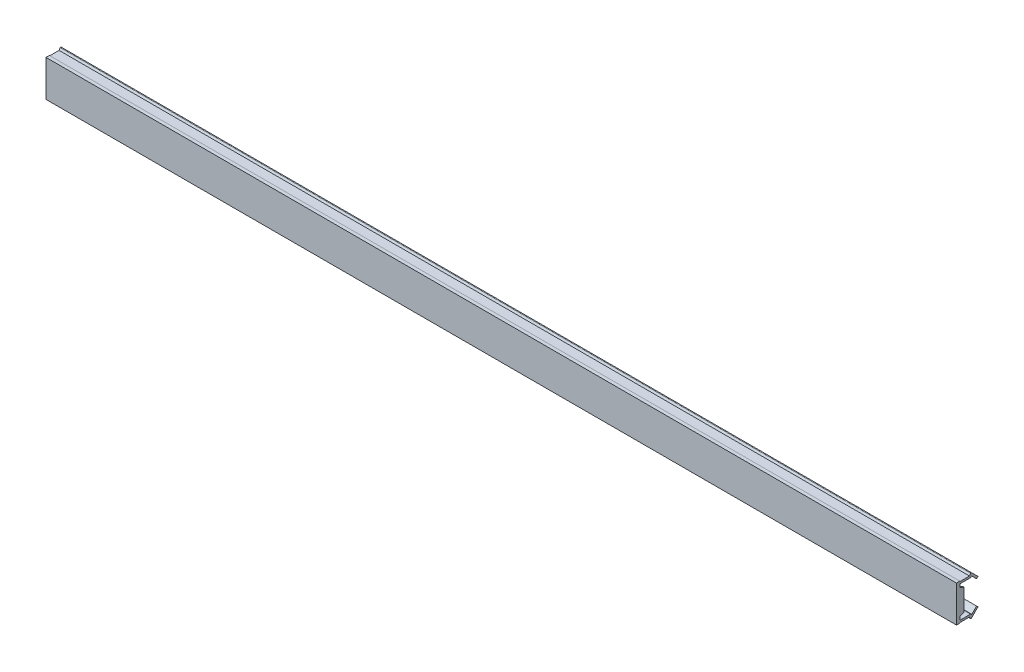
ISO-10303-21;
HEADER;
FILE_DESCRIPTION(('STEP AP214'),'2;1');
FILE_NAME('part.step','',(''),(''),'','','');
FILE_SCHEMA(('AUTOMOTIVE_DESIGN { 1 0 10303 214 1 1 1 1 }'));
ENDSEC;
DATA;
#1=APPLICATION_CONTEXT('core data for automotive mechanical design processes');
#2=APPLICATION_PROTOCOL_DEFINITION('international standard','automotive_design',2000,#1);
#3=PRODUCT_CONTEXT('',#1,'mechanical');
#4=PRODUCT('Part','Part','',(#3));
#5=PRODUCT_RELATED_PRODUCT_CATEGORY('part','',(#4));
#6=PRODUCT_DEFINITION_FORMATION('','',#4);
#7=PRODUCT_DEFINITION_CONTEXT('part definition',#1,'design');
#8=PRODUCT_DEFINITION('design','',#6,#7);
#9=PRODUCT_DEFINITION_SHAPE('','',#8);
#10=(LENGTH_UNIT() NAMED_UNIT(*) SI_UNIT(.MILLI.,.METRE.));
#11=(NAMED_UNIT(*) PLANE_ANGLE_UNIT() SI_UNIT($,.RADIAN.));
#12=(NAMED_UNIT(*) SI_UNIT($,.STERADIAN.) SOLID_ANGLE_UNIT());
#13=UNCERTAINTY_MEASURE_WITH_UNIT(LENGTH_MEASURE(1.E-05),#10,'distance_accuracy_value','');
#14=(GEOMETRIC_REPRESENTATION_CONTEXT(3) GLOBAL_UNCERTAINTY_ASSIGNED_CONTEXT((#13)) GLOBAL_UNIT_ASSIGNED_CONTEXT((#10,
#11,#12)) REPRESENTATION_CONTEXT('',''));
#15=CARTESIAN_POINT('',(0.,0.,0.));
#16=DIRECTION('',(0.,0.,1.));
#17=DIRECTION('',(1.,0.,0.));
#18=AXIS2_PLACEMENT_3D('',#15,#16,#17);
#19=CARTESIAN_POINT('',(0.,2.590763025,-1.1705));
#20=DIRECTION('',(0.,0.939692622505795,-0.342020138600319));
#21=DIRECTION('',(0.,0.342020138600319,0.939692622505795));
#22=AXIS2_PLACEMENT_3D('',#19,#20,#21);
#23=PLANE('',#22);
#24=DIRECTION('',(0.,-0.342020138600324,-0.939692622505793));
#25=VECTOR('',#24,1.);
#26=CARTESIAN_POINT('',(199.75,2.74381250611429,-0.75));
#27=LINE('',#26,#25);
#28=CARTESIAN_POINT('',(199.75,2.74381250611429,-0.749999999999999));
#29=VERTEX_POINT('',#28);
#30=CARTESIAN_POINT('',(199.75,2.43152605,-1.608));
#31=VERTEX_POINT('',#30);
#32=EDGE_CURVE('E409',#29,#31,#27,.T.);
#33=ORIENTED_EDGE('',*,*,#32,.F.);
#34=DIRECTION('',(1.,0.,0.));
#35=VECTOR('',#34,1.);
#36=CARTESIAN_POINT('',(100.25,2.74381250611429,-0.75));
#37=LINE('',#36,#35);
#38=CARTESIAN_POINT('',(0.75,2.74381250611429,-0.749999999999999));
#39=VERTEX_POINT('',#38);
#40=EDGE_CURVE('E326',#29,#39,#37,.F.);
#41=ORIENTED_EDGE('',*,*,#40,.T.);
#42=DIRECTION('',(0.,0.342020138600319,0.939692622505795));
#43=VECTOR('',#42,1.);
#44=CARTESIAN_POINT('',(0.75,2.590763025,-1.1705));
#45=LINE('',#44,#43);
#46=CARTESIAN_POINT('',(0.75,2.43152605,-1.608));
#47=VERTEX_POINT('',#46);
#48=EDGE_CURVE('E321',#39,#47,#45,.F.);
#49=ORIENTED_EDGE('',*,*,#48,.T.);
#50=DIRECTION('',(1.,0.,0.));
#51=VECTOR('',#50,1.);
#52=CARTESIAN_POINT('',(0.,2.43152605,-1.608));
#53=LINE('',#52,#51);
#54=CARTESIAN_POINT('',(0.,2.43152605,-1.608));
#55=VERTEX_POINT('',#54);
#56=EDGE_CURVE('E319',#47,#55,#53,.F.);
#57=ORIENTED_EDGE('',*,*,#56,.T.);
#58=DIRECTION('',(0.,0.342020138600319,0.939692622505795));
#59=VECTOR('',#58,1.);
#60=CARTESIAN_POINT('',(0.,2.590763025,-1.1705));
#61=LINE('',#60,#59);
#62=CARTESIAN_POINT('',(0.,2.75,-0.733));
#63=VERTEX_POINT('',#62);
#64=EDGE_CURVE('E317',#55,#63,#61,.T.);
#65=ORIENTED_EDGE('',*,*,#64,.T.);
#66=DIRECTION('',(-1.,0.,0.));
#67=VECTOR('',#66,1.);
#68=CARTESIAN_POINT('',(0.,2.75,-0.733));
#69=LINE('',#68,#67);
#70=CARTESIAN_POINT('',(200.,2.75,-0.733));
#71=VERTEX_POINT('',#70);
#72=EDGE_CURVE('E397',#71,#63,#69,.T.);
#73=ORIENTED_EDGE('',*,*,#72,.F.);
#74=DIRECTION('',(0.,0.342020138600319,0.939692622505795));
#75=VECTOR('',#74,1.);
#76=CARTESIAN_POINT('',(200.,2.590763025,-1.1705));
#77=LINE('',#76,#75);
#78=CARTESIAN_POINT('',(200.,2.43152605,-1.608));
#79=VERTEX_POINT('',#78);
#80=EDGE_CURVE('E314',#71,#79,#77,.F.);
#81=ORIENTED_EDGE('',*,*,#80,.T.);
#82=DIRECTION('',(1.,0.,0.));
#83=VECTOR('',#82,1.);
#84=CARTESIAN_POINT('',(0.,2.43152605,-1.608));
#85=LINE('',#84,#83);
#86=EDGE_CURVE('E232',#79,#31,#85,.F.);
#87=ORIENTED_EDGE('',*,*,#86,.T.);
#88=EDGE_LOOP('',(#33,#41,#49,#57,#65,#73,#81,#87));
#89=FACE_BOUND('',#88,.T.);
#90=ADVANCED_FACE('F15',(#89),#23,.T.);
#91=CARTESIAN_POINT('',(0.,3.5366617,-3.30191277));
#92=DIRECTION('',(1.,0.,0.));
#93=DIRECTION('',(0.,0.,-1.));
#94=AXIS2_PLACEMENT_3D('',#91,#92,#93);
#95=CYLINDRICAL_SURFACE('',#94,0.122000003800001);
#96=DIRECTION('',(1.,0.,0.));
#97=VECTOR('',#96,1.);
#98=CARTESIAN_POINT('',(0.,3.59766169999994,-3.19625766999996));
#99=LINE('',#98,#97);
#100=CARTESIAN_POINT('',(0.,3.5976616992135,-3.19625766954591));
#101=VERTEX_POINT('',#100);
#102=CARTESIAN_POINT('',(200.,3.5976616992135,-3.19625766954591));
#103=VERTEX_POINT('',#102);
#104=EDGE_CURVE('E229',#101,#103,#99,.T.);
#105=ORIENTED_EDGE('',*,*,#104,.F.);
#106=CARTESIAN_POINT('',(0.,3.5366617,-3.30191277));
#107=DIRECTION('',(1.,0.,0.));
#108=DIRECTION('',(0.,0.,-1.));
#109=AXIS2_PLACEMENT_3D('',#106,#107,#108);
#110=CIRCLE('',#109,0.122000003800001);
#111=CARTESIAN_POINT('',(0.,3.62292873,-3.3881798));
#112=VERTEX_POINT('',#111);
#113=EDGE_CURVE('E18',#112,#101,#110,.T.);
#114=ORIENTED_EDGE('',*,*,#113,.F.);
#115=DIRECTION('',(1.,0.,0.));
#116=VECTOR('',#115,1.);
#117=CARTESIAN_POINT('',(0.,3.62292873,-3.3881798));
#118=LINE('',#117,#116);
#119=CARTESIAN_POINT('',(200.,3.62292873,-3.3881798));
#120=VERTEX_POINT('',#119);
#121=EDGE_CURVE('E226',#120,#112,#118,.F.);
#122=ORIENTED_EDGE('',*,*,#121,.F.);
#123=CARTESIAN_POINT('',(200.,3.5366617,-3.30191277));
#124=DIRECTION('',(1.,0.,0.));
#125=DIRECTION('',(0.,0.,-1.));
#126=AXIS2_PLACEMENT_3D('',#123,#124,#125);
#127=CIRCLE('',#126,0.122000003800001);
#128=EDGE_CURVE('E231',#103,#120,#127,.F.);
#129=ORIENTED_EDGE('',*,*,#128,.F.);
#130=EDGE_LOOP('',(#105,#114,#122,#129));
#131=FACE_BOUND('',#130,.T.);
#132=ADVANCED_FACE('F223',(#131),#95,.F.);
#133=CARTESIAN_POINT('',(0.,3.105375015,-3.905733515));
#134=DIRECTION('',(0.,-0.707106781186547,0.707106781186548));
#135=DIRECTION('',(0.,-0.707106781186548,-0.707106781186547));
#136=AXIS2_PLACEMENT_3D('',#133,#134,#135);
#137=PLANE('',#136);
#138=DIRECTION('',(0.,-0.707106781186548,-0.707106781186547));
#139=VECTOR('',#138,1.);
#140=CARTESIAN_POINT('',(0.,3.105375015,-3.905733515));
#141=LINE('',#140,#139);
#142=CARTESIAN_POINT('',(0.,2.5878213,-4.42328723));
#143=VERTEX_POINT('',#142);
#144=EDGE_CURVE('E234',#112,#143,#141,.T.);
#145=ORIENTED_EDGE('',*,*,#144,.T.);
#146=DIRECTION('',(1.,0.,0.));
#147=VECTOR('',#146,1.);
#148=CARTESIAN_POINT('',(0.,2.5878213,-4.42328723));
#149=LINE('',#148,#147);
#150=CARTESIAN_POINT('',(200.,2.5878213,-4.42328723));
#151=VERTEX_POINT('',#150);
#152=EDGE_CURVE('E282',#151,#143,#149,.F.);
#153=ORIENTED_EDGE('',*,*,#152,.F.);
#154=DIRECTION('',(0.,-0.707106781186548,-0.707106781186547));
#155=VECTOR('',#154,1.);
#156=CARTESIAN_POINT('',(200.,3.105375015,-3.905733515));
#157=LINE('',#156,#155);
#158=EDGE_CURVE('E245',#151,#120,#157,.F.);
#159=ORIENTED_EDGE('',*,*,#158,.T.);
#160=ORIENTED_EDGE('',*,*,#121,.T.);
#161=EDGE_LOOP('',(#145,#153,#159,#160));
#162=FACE_BOUND('',#161,.T.);
#163=ADVANCED_FACE('F244',(#162),#137,.T.);
#164=CARTESIAN_POINT('',(0.,-3.105374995,-3.905733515));
#165=DIRECTION('',(0.,0.707106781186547,0.707106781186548));
#166=DIRECTION('',(0.,-0.707106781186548,0.707106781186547));
#167=AXIS2_PLACEMENT_3D('',#164,#165,#166);
#168=PLANE('',#167);
#169=DIRECTION('',(0.,-0.707106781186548,0.707106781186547));
#170=VECTOR('',#169,1.);
#171=CARTESIAN_POINT('',(0.,-3.105374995,-3.905733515));
#172=LINE('',#171,#170);
#173=CARTESIAN_POINT('',(0.,-2.58782128,-4.42328723));
#174=VERTEX_POINT('',#173);
#175=CARTESIAN_POINT('',(0.,-3.62292870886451,-3.38817979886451));
#176=VERTEX_POINT('',#175);
#177=EDGE_CURVE('E269',#174,#176,#172,.T.);
#178=ORIENTED_EDGE('',*,*,#177,.T.);
#179=DIRECTION('',(1.,0.,0.));
#180=VECTOR('',#179,1.);
#181=CARTESIAN_POINT('',(0.,-3.62292870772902,-3.38817979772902));
#182=LINE('',#181,#180);
#183=CARTESIAN_POINT('',(200.,-3.62292870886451,-3.38817979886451));
#184=VERTEX_POINT('',#183);
#185=EDGE_CURVE('E250',#176,#184,#182,.T.);
#186=ORIENTED_EDGE('',*,*,#185,.T.);
#187=DIRECTION('',(0.,-0.707106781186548,0.707106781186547));
#188=VECTOR('',#187,1.);
#189=CARTESIAN_POINT('',(200.,-3.105374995,-3.905733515));
#190=LINE('',#189,#188);
#191=CARTESIAN_POINT('',(200.,-2.58782128,-4.42328723));
#192=VERTEX_POINT('',#191);
#193=EDGE_CURVE('E242',#184,#192,#190,.F.);
#194=ORIENTED_EDGE('',*,*,#193,.T.);
#195=DIRECTION('',(1.,0.,0.));
#196=VECTOR('',#195,1.);
#197=CARTESIAN_POINT('',(0.,-2.58782128,-4.42328723));
#198=LINE('',#197,#196);
#199=EDGE_CURVE('E385',#174,#192,#198,.T.);
#200=ORIENTED_EDGE('',*,*,#199,.F.);
#201=EDGE_LOOP('',(#178,#186,#194,#200));
#202=FACE_BOUND('',#201,.T.);
#203=ADVANCED_FACE('F672',(#202),#168,.T.);
#204=CARTESIAN_POINT('',(0.,-3.53666168,-3.30191277));
#205=DIRECTION('',(1.,0.,0.));
#206=DIRECTION('',(0.,0.,-1.));
#207=AXIS2_PLACEMENT_3D('',#204,#205,#206);
#208=CYLINDRICAL_SURFACE('',#207,0.122000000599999);
#209=ORIENTED_EDGE('',*,*,#185,.F.);
#210=CARTESIAN_POINT('',(0.,-3.53666168,-3.30191277));
#211=DIRECTION('',(1.,0.,0.));
#212=DIRECTION('',(0.,0.,-1.));
#213=AXIS2_PLACEMENT_3D('',#210,#211,#212);
#214=CIRCLE('',#213,0.122000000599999);
#215=CARTESIAN_POINT('',(0.,-3.59766167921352,-3.19625766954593));
#216=VERTEX_POINT('',#215);
#217=EDGE_CURVE('E268',#216,#176,#214,.T.);
#218=ORIENTED_EDGE('',*,*,#217,.F.);
#219=DIRECTION('',(1.,0.,0.));
#220=VECTOR('',#219,1.);
#221=CARTESIAN_POINT('',(0.,-3.59766168,-3.19625767));
#222=LINE('',#221,#220);
#223=CARTESIAN_POINT('',(200.,-3.59766167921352,-3.19625766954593));
#224=VERTEX_POINT('',#223);
#225=EDGE_CURVE('E427',#224,#216,#222,.F.);
#226=ORIENTED_EDGE('',*,*,#225,.F.);
#227=CARTESIAN_POINT('',(200.,-3.53666168,-3.30191277));
#228=DIRECTION('',(1.,0.,0.));
#229=DIRECTION('',(0.,0.,-1.));
#230=AXIS2_PLACEMENT_3D('',#227,#228,#229);
#231=CIRCLE('',#230,0.122000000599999);
#232=EDGE_CURVE('E265',#184,#224,#231,.F.);
#233=ORIENTED_EDGE('',*,*,#232,.F.);
#234=EDGE_LOOP('',(#209,#218,#226,#233));
#235=FACE_BOUND('',#234,.T.);
#236=ADVANCED_FACE('F677',(#235),#208,.F.);
#237=CARTESIAN_POINT('',(0.,-2.590763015,-1.1705));
#238=DIRECTION('',(0.,-0.939692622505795,-0.342020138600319));
#239=DIRECTION('',(0.,0.342020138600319,-0.939692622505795));
#240=AXIS2_PLACEMENT_3D('',#237,#238,#239);
#241=PLANE('',#240);
#242=DIRECTION('',(0.,0.342020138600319,-0.939692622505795));
#243=VECTOR('',#242,1.);
#244=CARTESIAN_POINT('',(0.,-2.590763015,-1.1705));
#245=LINE('',#244,#243);
#246=CARTESIAN_POINT('',(0.,-2.74999999,-0.733));
#247=VERTEX_POINT('',#246);
#248=CARTESIAN_POINT('',(0.,-2.43152604,-1.608));
#249=VERTEX_POINT('',#248);
#250=EDGE_CURVE('E417',#247,#249,#245,.T.);
#251=ORIENTED_EDGE('',*,*,#250,.T.);
#252=DIRECTION('',(1.,0.,0.));
#253=VECTOR('',#252,1.);
#254=CARTESIAN_POINT('',(0.,-2.43152604,-1.608));
#255=LINE('',#254,#253);
#256=CARTESIAN_POINT('',(0.75,-2.43152604,-1.608));
#257=VERTEX_POINT('',#256);
#258=EDGE_CURVE('E415',#249,#257,#255,.T.);
#259=ORIENTED_EDGE('',*,*,#258,.T.);
#260=DIRECTION('',(0.,0.342020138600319,-0.939692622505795));
#261=VECTOR('',#260,1.);
#262=CARTESIAN_POINT('',(0.75,-2.590763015,-1.1705));
#263=LINE('',#262,#261);
#264=CARTESIAN_POINT('',(0.75,-2.74381249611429,-0.749999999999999));
#265=VERTEX_POINT('',#264);
#266=EDGE_CURVE('E267',#257,#265,#263,.F.);
#267=ORIENTED_EDGE('',*,*,#266,.T.);
#268=DIRECTION('',(1.,0.,0.));
#269=VECTOR('',#268,1.);
#270=CARTESIAN_POINT('',(100.25,-2.74381249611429,-0.75));
#271=LINE('',#270,#269);
#272=CARTESIAN_POINT('',(199.75,-2.74381249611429,-0.749999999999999));
#273=VERTEX_POINT('',#272);
#274=EDGE_CURVE('E413',#265,#273,#271,.T.);
#275=ORIENTED_EDGE('',*,*,#274,.T.);
#276=DIRECTION('',(0.,-0.342020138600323,0.939692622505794));
#277=VECTOR('',#276,1.);
#278=CARTESIAN_POINT('',(199.75,-2.43152604,-1.608));
#279=LINE('',#278,#277);
#280=CARTESIAN_POINT('',(199.75,-2.43152604,-1.608));
#281=VERTEX_POINT('',#280);
#282=EDGE_CURVE('E406',#281,#273,#279,.T.);
#283=ORIENTED_EDGE('',*,*,#282,.F.);
#284=DIRECTION('',(1.,0.,0.));
#285=VECTOR('',#284,1.);
#286=CARTESIAN_POINT('',(0.,-2.43152604,-1.608));
#287=LINE('',#286,#285);
#288=CARTESIAN_POINT('',(200.,-2.43152604,-1.608));
#289=VERTEX_POINT('',#288);
#290=EDGE_CURVE('E423',#281,#289,#287,.T.);
#291=ORIENTED_EDGE('',*,*,#290,.T.);
#292=DIRECTION('',(0.,0.342020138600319,-0.939692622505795));
#293=VECTOR('',#292,1.);
#294=CARTESIAN_POINT('',(200.,-2.590763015,-1.1705));
#295=LINE('',#294,#293);
#296=CARTESIAN_POINT('',(200.,-2.74999999,-0.733));
#297=VERTEX_POINT('',#296);
#298=EDGE_CURVE('E420',#289,#297,#295,.F.);
#299=ORIENTED_EDGE('',*,*,#298,.T.);
#300=DIRECTION('',(-1.,0.,0.));
#301=VECTOR('',#300,1.);
#302=CARTESIAN_POINT('',(0.,-2.74999999,-0.733));
#303=LINE('',#302,#301);
#304=EDGE_CURVE('E373',#247,#297,#303,.F.);
#305=ORIENTED_EDGE('',*,*,#304,.F.);
#306=EDGE_LOOP('',(#251,#259,#267,#275,#283,#291,#299,#305));
#307=FACE_BOUND('',#306,.T.);
#308=ADVANCED_FACE('F689',(#307),#241,.T.);
#309=CARTESIAN_POINT('',(100.25,0.,-0.75));
#310=DIRECTION('',(0.,0.,1.));
#311=DIRECTION('',(1.,0.,0.));
#312=AXIS2_PLACEMENT_3D('',#309,#310,#311);
#313=PLANE('',#312);
#314=DIRECTION('',(0.,1.,0.));
#315=VECTOR('',#314,1.);
#316=CARTESIAN_POINT('',(199.75,0.,-0.75));
#317=LINE('',#316,#315);
#318=EDGE_CURVE('E403',#273,#29,#317,.T.);
#319=ORIENTED_EDGE('',*,*,#318,.F.);
#320=ORIENTED_EDGE('',*,*,#274,.F.);
#321=DIRECTION('',(0.,1.,0.));
#322=VECTOR('',#321,1.);
#323=CARTESIAN_POINT('',(0.75,0.,-0.75));
#324=LINE('',#323,#322);
#325=EDGE_CURVE('E332',#39,#265,#324,.F.);
#326=ORIENTED_EDGE('',*,*,#325,.F.);
#327=ORIENTED_EDGE('',*,*,#40,.F.);
#328=EDGE_LOOP('',(#319,#320,#326,#327));
#329=FACE_BOUND('',#328,.T.);
#330=ADVANCED_FACE('F697',(#329),#313,.F.);
#331=CARTESIAN_POINT('',(199.75,0.,-1.25));
#332=DIRECTION('',(-1.,0.,0.));
#333=DIRECTION('',(0.,0.,1.));
#334=AXIS2_PLACEMENT_3D('',#331,#332,#333);
#335=PLANE('',#334);
#336=ORIENTED_EDGE('',*,*,#282,.T.);
#337=ORIENTED_EDGE('',*,*,#318,.T.);
#338=ORIENTED_EDGE('',*,*,#32,.T.);
#339=DIRECTION('',(0.,1.,0.));
#340=VECTOR('',#339,1.);
#341=CARTESIAN_POINT('',(199.75,4.99999996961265E-09,-1.608));
#342=LINE('',#341,#340);
#343=EDGE_CURVE('E369',#281,#31,#342,.T.);
#344=ORIENTED_EDGE('',*,*,#343,.F.);
#345=EDGE_LOOP('',(#336,#337,#338,#344));
#346=FACE_BOUND('',#345,.T.);
#347=ADVANCED_FACE('F694',(#346),#335,.T.);
#348=CARTESIAN_POINT('',(0.,3.106000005,-0.733));
#349=DIRECTION('',(0.,0.,-1.));
#350=DIRECTION('',(-1.,0.,0.));
#351=AXIS2_PLACEMENT_3D('',#348,#349,#350);
#352=PLANE('',#351);
#353=DIRECTION('',(0.,1.,0.));
#354=VECTOR('',#353,1.);
#355=CARTESIAN_POINT('',(0.,3.106000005,-0.733));
#356=LINE('',#355,#354);
#357=CARTESIAN_POINT('',(0.,3.46200001,-0.733));
#358=VERTEX_POINT('',#357);
#359=EDGE_CURVE('E304',#63,#358,#356,.T.);
#360=ORIENTED_EDGE('',*,*,#359,.T.);
#361=DIRECTION('',(1.,0.,0.));
#362=VECTOR('',#361,1.);
#363=CARTESIAN_POINT('',(0.,3.46200001,-0.733));
#364=LINE('',#363,#362);
#365=CARTESIAN_POINT('',(200.,3.46200001,-0.733));
#366=VERTEX_POINT('',#365);
#367=EDGE_CURVE('E293',#366,#358,#364,.F.);
#368=ORIENTED_EDGE('',*,*,#367,.F.);
#369=DIRECTION('',(0.,1.,0.));
#370=VECTOR('',#369,1.);
#371=CARTESIAN_POINT('',(200.,3.106000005,-0.733));
#372=LINE('',#371,#370);
#373=EDGE_CURVE('E400',#366,#71,#372,.F.);
#374=ORIENTED_EDGE('',*,*,#373,.T.);
#375=ORIENTED_EDGE('',*,*,#72,.T.);
#376=EDGE_LOOP('',(#360,#368,#374,#375));
#377=FACE_BOUND('',#376,.T.);
#378=ADVANCED_FACE('F543',(#377),#352,.T.);
#379=CARTESIAN_POINT('',(0.,3.52983085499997,-3.15709551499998));
#380=DIRECTION('',(0.,-0.499999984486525,-0.866025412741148));
#381=DIRECTION('',(0.,0.866025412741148,-0.499999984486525));
#382=AXIS2_PLACEMENT_3D('',#379,#380,#381);
#383=PLANE('',#382);
#384=DIRECTION('',(0.,0.866025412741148,-0.499999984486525));
#385=VECTOR('',#384,1.);
#386=CARTESIAN_POINT('',(0.,3.52983085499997,-3.15709551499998));
#387=LINE('',#386,#385);
#388=CARTESIAN_POINT('',(0.,3.46200001,-3.11793336));
#389=VERTEX_POINT('',#388);
#390=EDGE_CURVE('E278',#389,#101,#387,.T.);
#391=ORIENTED_EDGE('',*,*,#390,.T.);
#392=ORIENTED_EDGE('',*,*,#104,.T.);
#393=DIRECTION('',(0.,0.866025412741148,-0.499999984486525));
#394=VECTOR('',#393,1.);
#395=CARTESIAN_POINT('',(200.,3.52983085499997,-3.15709551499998));
#396=LINE('',#395,#394);
#397=CARTESIAN_POINT('',(200.,3.46200001,-3.11793336));
#398=VERTEX_POINT('',#397);
#399=EDGE_CURVE('E273',#103,#398,#396,.F.);
#400=ORIENTED_EDGE('',*,*,#399,.T.);
#401=DIRECTION('',(1.,0.,0.));
#402=VECTOR('',#401,1.);
#403=CARTESIAN_POINT('',(0.,3.46200001,-3.11793336));
#404=LINE('',#403,#402);
#405=EDGE_CURVE('E290',#389,#398,#404,.T.);
#406=ORIENTED_EDGE('',*,*,#405,.F.);
#407=EDGE_LOOP('',(#391,#392,#400,#406));
#408=FACE_BOUND('',#407,.T.);
#409=ADVANCED_FACE('F275',(#408),#383,.T.);
#410=CARTESIAN_POINT('',(0.,2.742677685,-4.578143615));
#411=DIRECTION('',(0.,-0.707106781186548,-0.707106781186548));
#412=DIRECTION('',(0.,0.707106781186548,-0.707106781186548));
#413=AXIS2_PLACEMENT_3D('',#410,#411,#412);
#414=PLANE('',#413);
#415=DIRECTION('',(0.,0.707106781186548,-0.707106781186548));
#416=VECTOR('',#415,1.);
#417=CARTESIAN_POINT('',(0.,2.742677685,-4.578143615));
#418=LINE('',#417,#416);
#419=CARTESIAN_POINT('',(0.,2.89753407,-4.733));
#420=VERTEX_POINT('',#419);
#421=EDGE_CURVE('E238',#143,#420,#418,.T.);
#422=ORIENTED_EDGE('',*,*,#421,.T.);
#423=DIRECTION('',(1.,0.,0.));
#424=VECTOR('',#423,1.);
#425=CARTESIAN_POINT('',(0.,2.89753407,-4.733));
#426=LINE('',#425,#424);
#427=CARTESIAN_POINT('',(200.,2.89753407,-4.733));
#428=VERTEX_POINT('',#427);
#429=EDGE_CURVE('E292',#428,#420,#426,.F.);
#430=ORIENTED_EDGE('',*,*,#429,.F.);
#431=DIRECTION('',(0.,0.707106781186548,-0.707106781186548));
#432=VECTOR('',#431,1.);
#433=CARTESIAN_POINT('',(200.,2.742677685,-4.578143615));
#434=LINE('',#433,#432);
#435=EDGE_CURVE('E279',#428,#151,#434,.F.);
#436=ORIENTED_EDGE('',*,*,#435,.T.);
#437=ORIENTED_EDGE('',*,*,#152,.T.);
#438=EDGE_LOOP('',(#422,#430,#436,#437));
#439=FACE_BOUND('',#438,.T.);
#440=ADVANCED_FACE('F525',(#439),#414,.T.);
#441=CARTESIAN_POINT('',(0.,4.25000001,-3.208));
#442=DIRECTION('',(1.,0.,0.));
#443=DIRECTION('',(0.,0.,-1.));
#444=AXIS2_PLACEMENT_3D('',#441,#442,#443);
#445=CYLINDRICAL_SURFACE('',#444,0.122000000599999);
#446=CARTESIAN_POINT('',(0.,4.25000001,-3.208));
#447=DIRECTION('',(1.,0.,0.));
#448=DIRECTION('',(0.,0.,-1.));
#449=AXIS2_PLACEMENT_3D('',#446,#447,#448);
#450=CIRCLE('',#449,0.122000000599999);
#451=CARTESIAN_POINT('',(0.,4.33626703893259,-3.29426702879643));
#452=VERTEX_POINT('',#451);
#453=CARTESIAN_POINT('',(0.,4.31100001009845,-3.10234490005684));
#454=VERTEX_POINT('',#453);
#455=EDGE_CURVE('E260',#452,#454,#450,.T.);
#456=ORIENTED_EDGE('',*,*,#455,.T.);
#457=DIRECTION('',(1.,0.,0.));
#458=VECTOR('',#457,1.);
#459=CARTESIAN_POINT('',(0.,4.31100001,-3.1023449));
#460=LINE('',#459,#458);
#461=CARTESIAN_POINT('',(200.,4.31100001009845,-3.10234490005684));
#462=VERTEX_POINT('',#461);
#463=EDGE_CURVE('E494',#462,#454,#460,.F.);
#464=ORIENTED_EDGE('',*,*,#463,.F.);
#465=CARTESIAN_POINT('',(200.,4.25000001,-3.208));
#466=DIRECTION('',(1.,0.,0.));
#467=DIRECTION('',(0.,0.,-1.));
#468=AXIS2_PLACEMENT_3D('',#465,#466,#467);
#469=CIRCLE('',#468,0.122000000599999);
#470=CARTESIAN_POINT('',(200.,4.33626703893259,-3.29426702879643));
#471=VERTEX_POINT('',#470);
#472=EDGE_CURVE('E263',#462,#471,#469,.F.);
#473=ORIENTED_EDGE('',*,*,#472,.T.);
#474=DIRECTION('',(1.,0.,0.));
#475=VECTOR('',#474,1.);
#476=CARTESIAN_POINT('',(0.,4.33626704,-3.29426703));
#477=LINE('',#476,#475);
#478=EDGE_CURVE('E358',#452,#471,#477,.T.);
#479=ORIENTED_EDGE('',*,*,#478,.F.);
#480=EDGE_LOOP('',(#456,#464,#473,#479));
#481=FACE_BOUND('',#480,.T.);
#482=ADVANCED_FACE('F611',(#481),#445,.T.);
#483=CARTESIAN_POINT('',(0.,4.10550001,-2.98369942));
#484=DIRECTION('',(0.,0.499999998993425,0.866025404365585));
#485=DIRECTION('',(0.,-0.866025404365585,0.499999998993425));
#486=AXIS2_PLACEMENT_3D('',#483,#484,#485);
#487=PLANE('',#486);
#488=DIRECTION('',(0.,-0.866025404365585,0.499999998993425));
#489=VECTOR('',#488,1.);
#490=CARTESIAN_POINT('',(0.,4.10550001,-2.98369942));
#491=LINE('',#490,#489);
#492=CARTESIAN_POINT('',(0.,3.90000001,-2.86505394));
#493=VERTEX_POINT('',#492);
#494=EDGE_CURVE('E475',#454,#493,#491,.T.);
#495=ORIENTED_EDGE('',*,*,#494,.T.);
#496=DIRECTION('',(1.,0.,0.));
#497=VECTOR('',#496,1.);
#498=CARTESIAN_POINT('',(0.,3.90000001,-2.86505394));
#499=LINE('',#498,#497);
#500=CARTESIAN_POINT('',(200.,3.90000001,-2.86505394));
#501=VERTEX_POINT('',#500);
#502=EDGE_CURVE('E357',#501,#493,#499,.F.);
#503=ORIENTED_EDGE('',*,*,#502,.F.);
#504=DIRECTION('',(0.,-0.866025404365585,0.499999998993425));
#505=VECTOR('',#504,1.);
#506=CARTESIAN_POINT('',(200.,4.10550001,-2.98369942));
#507=LINE('',#506,#505);
#508=EDGE_CURVE('E262',#501,#462,#507,.F.);
#509=ORIENTED_EDGE('',*,*,#508,.T.);
#510=ORIENTED_EDGE('',*,*,#463,.T.);
#511=EDGE_LOOP('',(#495,#503,#509,#510));
#512=FACE_BOUND('',#511,.T.);
#513=ADVANCED_FACE('F608',(#512),#487,.T.);
#514=CARTESIAN_POINT('',(0.,-4.10549998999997,-2.98369941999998));
#515=DIRECTION('',(0.,-0.499999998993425,0.866025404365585));
#516=DIRECTION('',(0.,-0.866025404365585,-0.499999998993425));
#517=AXIS2_PLACEMENT_3D('',#514,#515,#516);
#518=PLANE('',#517);
#519=DIRECTION('',(0.,-0.866025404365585,-0.499999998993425));
#520=VECTOR('',#519,1.);
#521=CARTESIAN_POINT('',(0.,-4.10549998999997,-2.98369941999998));
#522=LINE('',#521,#520);
#523=CARTESIAN_POINT('',(0.,-3.89999999,-2.86505394));
#524=VERTEX_POINT('',#523);
#525=CARTESIAN_POINT('',(0.,-4.31099999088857,-3.10234489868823));
#526=VERTEX_POINT('',#525);
#527=EDGE_CURVE('E259',#524,#526,#522,.T.);
#528=ORIENTED_EDGE('',*,*,#527,.T.);
#529=DIRECTION('',(1.,0.,0.));
#530=VECTOR('',#529,1.);
#531=CARTESIAN_POINT('',(0.,-4.31099999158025,-3.10234489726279));
#532=LINE('',#531,#530);
#533=CARTESIAN_POINT('',(200.,-4.31099999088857,-3.10234489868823));
#534=VERTEX_POINT('',#533);
#535=EDGE_CURVE('E255',#534,#526,#532,.F.);
#536=ORIENTED_EDGE('',*,*,#535,.F.);
#537=DIRECTION('',(0.,-0.866025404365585,-0.499999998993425));
#538=VECTOR('',#537,1.);
#539=CARTESIAN_POINT('',(200.,-4.10549998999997,-2.98369941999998));
#540=LINE('',#539,#538);
#541=CARTESIAN_POINT('',(200.,-3.89999999,-2.86505394));
#542=VERTEX_POINT('',#541);
#543=EDGE_CURVE('E471',#534,#542,#540,.F.);
#544=ORIENTED_EDGE('',*,*,#543,.T.);
#545=DIRECTION('',(1.,0.,0.));
#546=VECTOR('',#545,1.);
#547=CARTESIAN_POINT('',(0.,-3.89999999,-2.86505394));
#548=LINE('',#547,#546);
#549=EDGE_CURVE('E350',#524,#542,#548,.T.);
#550=ORIENTED_EDGE('',*,*,#549,.F.);
#551=EDGE_LOOP('',(#528,#536,#544,#550));
#552=FACE_BOUND('',#551,.T.);
#553=ADVANCED_FACE('F661',(#552),#518,.T.);
#554=CARTESIAN_POINT('',(0.,-4.24999999,-3.208));
#555=DIRECTION('',(1.,0.,0.));
#556=DIRECTION('',(0.,0.,-1.));
#557=AXIS2_PLACEMENT_3D('',#554,#555,#556);
#558=CYLINDRICAL_SURFACE('',#557,0.122000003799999);
#559=CARTESIAN_POINT('',(0.,-4.24999999,-3.208));
#560=DIRECTION('',(1.,0.,0.));
#561=DIRECTION('',(0.,0.,-1.));
#562=AXIS2_PLACEMENT_3D('',#559,#560,#561);
#563=CIRCLE('',#562,0.122000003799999);
#564=CARTESIAN_POINT('',(0.,-4.33626702,-3.29426703));
#565=VERTEX_POINT('',#564);
#566=EDGE_CURVE('E252',#526,#565,#563,.T.);
#567=ORIENTED_EDGE('',*,*,#566,.T.);
#568=DIRECTION('',(1.,0.,0.));
#569=VECTOR('',#568,1.);
#570=CARTESIAN_POINT('',(0.,-4.33626702,-3.29426703));
#571=LINE('',#570,#569);
#572=CARTESIAN_POINT('',(200.,-4.33626702,-3.29426703));
#573=VERTEX_POINT('',#572);
#574=EDGE_CURVE('E346',#573,#565,#571,.F.);
#575=ORIENTED_EDGE('',*,*,#574,.F.);
#576=CARTESIAN_POINT('',(200.,-4.24999999,-3.208));
#577=DIRECTION('',(1.,0.,0.));
#578=DIRECTION('',(0.,0.,-1.));
#579=AXIS2_PLACEMENT_3D('',#576,#577,#578);
#580=CIRCLE('',#579,0.122000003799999);
#581=EDGE_CURVE('E256',#573,#534,#580,.F.);
#582=ORIENTED_EDGE('',*,*,#581,.T.);
#583=ORIENTED_EDGE('',*,*,#535,.T.);
#584=EDGE_LOOP('',(#567,#575,#582,#583));
#585=FACE_BOUND('',#584,.T.);
#586=ADVANCED_FACE('F665',(#585),#558,.T.);
#587=CARTESIAN_POINT('',(0.,-2.742677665,-4.578143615));
#588=DIRECTION('',(0.,0.707106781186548,-0.707106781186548));
#589=DIRECTION('',(0.,0.707106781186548,0.707106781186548));
#590=AXIS2_PLACEMENT_3D('',#587,#588,#589);
#591=PLANE('',#590);
#592=DIRECTION('',(0.,0.707106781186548,0.707106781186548));
#593=VECTOR('',#592,1.);
#594=CARTESIAN_POINT('',(0.,-2.742677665,-4.578143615));
#595=LINE('',#594,#593);
#596=CARTESIAN_POINT('',(0.,-2.89753405,-4.733));
#597=VERTEX_POINT('',#596);
#598=EDGE_CURVE('E382',#597,#174,#595,.T.);
#599=ORIENTED_EDGE('',*,*,#598,.T.);
#600=ORIENTED_EDGE('',*,*,#199,.T.);
#601=DIRECTION('',(0.,0.707106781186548,0.707106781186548));
#602=VECTOR('',#601,1.);
#603=CARTESIAN_POINT('',(200.,-2.742677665,-4.578143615));
#604=LINE('',#603,#602);
#605=CARTESIAN_POINT('',(200.,-2.89753405,-4.733));
#606=VERTEX_POINT('',#605);
#607=EDGE_CURVE('E254',#192,#606,#604,.F.);
#608=ORIENTED_EDGE('',*,*,#607,.T.);
#609=DIRECTION('',(1.,0.,0.));
#610=VECTOR('',#609,1.);
#611=CARTESIAN_POINT('',(0.,-2.89753405,-4.733));
#612=LINE('',#611,#610);
#613=EDGE_CURVE('E349',#597,#606,#612,.T.);
#614=ORIENTED_EDGE('',*,*,#613,.F.);
#615=EDGE_LOOP('',(#599,#600,#608,#614));
#616=FACE_BOUND('',#615,.T.);
#617=ADVANCED_FACE('F668',(#616),#591,.T.);
#618=CARTESIAN_POINT('',(0.,-3.529830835,-3.157095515));
#619=DIRECTION('',(0.,0.499999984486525,-0.866025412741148));
#620=DIRECTION('',(0.,0.866025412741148,0.499999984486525));
#621=AXIS2_PLACEMENT_3D('',#618,#619,#620);
#622=PLANE('',#621);
#623=DIRECTION('',(0.,0.866025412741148,0.499999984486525));
#624=VECTOR('',#623,1.);
#625=CARTESIAN_POINT('',(0.,-3.529830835,-3.157095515));
#626=LINE('',#625,#624);
#627=CARTESIAN_POINT('',(0.,-3.46199999,-3.11793336));
#628=VERTEX_POINT('',#627);
#629=EDGE_CURVE('E381',#216,#628,#626,.T.);
#630=ORIENTED_EDGE('',*,*,#629,.T.);
#631=DIRECTION('',(1.,0.,0.));
#632=VECTOR('',#631,1.);
#633=CARTESIAN_POINT('',(0.,-3.46199999,-3.11793336));
#634=LINE('',#633,#632);
#635=CARTESIAN_POINT('',(200.,-3.46199999,-3.11793336));
#636=VERTEX_POINT('',#635);
#637=EDGE_CURVE('E342',#636,#628,#634,.F.);
#638=ORIENTED_EDGE('',*,*,#637,.F.);
#639=DIRECTION('',(0.,0.866025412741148,0.499999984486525));
#640=VECTOR('',#639,1.);
#641=CARTESIAN_POINT('',(200.,-3.529830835,-3.157095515));
#642=LINE('',#641,#640);
#643=EDGE_CURVE('E430',#636,#224,#642,.F.);
#644=ORIENTED_EDGE('',*,*,#643,.T.);
#645=ORIENTED_EDGE('',*,*,#225,.T.);
#646=EDGE_LOOP('',(#630,#638,#644,#645));
#647=FACE_BOUND('',#646,.T.);
#648=ADVANCED_FACE('F681',(#647),#622,.T.);
#649=CARTESIAN_POINT('',(0.,-3.10599999,-0.733));
#650=DIRECTION('',(0.,0.,-1.));
#651=DIRECTION('',(-1.,0.,0.));
#652=AXIS2_PLACEMENT_3D('',#649,#650,#651);
#653=PLANE('',#652);
#654=DIRECTION('',(0.,1.,0.));
#655=VECTOR('',#654,1.);
#656=CARTESIAN_POINT('',(0.,-3.10599999,-0.733));
#657=LINE('',#656,#655);
#658=CARTESIAN_POINT('',(0.,-3.46199999,-0.733));
#659=VERTEX_POINT('',#658);
#660=EDGE_CURVE('E376',#659,#247,#657,.T.);
#661=ORIENTED_EDGE('',*,*,#660,.T.);
#662=ORIENTED_EDGE('',*,*,#304,.T.);
#663=DIRECTION('',(0.,1.,0.));
#664=VECTOR('',#663,1.);
#665=CARTESIAN_POINT('',(200.,-3.10599999,-0.733));
#666=LINE('',#665,#664);
#667=CARTESIAN_POINT('',(200.,-3.46199999,-0.733));
#668=VERTEX_POINT('',#667);
#669=EDGE_CURVE('E379',#297,#668,#666,.F.);
#670=ORIENTED_EDGE('',*,*,#669,.T.);
#671=DIRECTION('',(1.,0.,0.));
#672=VECTOR('',#671,1.);
#673=CARTESIAN_POINT('',(0.,-3.46199999,-0.733));
#674=LINE('',#673,#672);
#675=EDGE_CURVE('E338',#659,#668,#674,.T.);
#676=ORIENTED_EDGE('',*,*,#675,.F.);
#677=EDGE_LOOP('',(#661,#662,#670,#676));
#678=FACE_BOUND('',#677,.T.);
#679=ADVANCED_FACE('F686',(#678),#653,.T.);
#680=CARTESIAN_POINT('',(0.75,0.,-1.25));
#681=DIRECTION('',(1.,0.,0.));
#682=DIRECTION('',(0.,0.,-1.));
#683=AXIS2_PLACEMENT_3D('',#680,#681,#682);
#684=PLANE('',#683);
#685=ORIENTED_EDGE('',*,*,#266,.F.);
#686=DIRECTION('',(0.,1.,0.));
#687=VECTOR('',#686,1.);
#688=CARTESIAN_POINT('',(0.75,4.99999996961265E-09,-1.608));
#689=LINE('',#688,#687);
#690=EDGE_CURVE('E334',#47,#257,#689,.F.);
#691=ORIENTED_EDGE('',*,*,#690,.F.);
#692=ORIENTED_EDGE('',*,*,#48,.F.);
#693=ORIENTED_EDGE('',*,*,#325,.T.);
#694=EDGE_LOOP('',(#685,#691,#692,#693));
#695=FACE_BOUND('',#694,.T.);
#696=ADVANCED_FACE('F331',(#695),#684,.T.);
#697=CARTESIAN_POINT('',(0.,4.99999996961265E-09,-1.608));
#698=DIRECTION('',(0.,0.,-1.));
#699=DIRECTION('',(-1.,0.,0.));
#700=AXIS2_PLACEMENT_3D('',#697,#698,#699);
#701=PLANE('',#700);
#702=DIRECTION('',(0.,1.,0.));
#703=VECTOR('',#702,1.);
#704=CARTESIAN_POINT('',(200.,9.72043688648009E-09,-1.608));
#705=LINE('',#704,#703);
#706=EDGE_CURVE('E310',#289,#79,#705,.T.);
#707=ORIENTED_EDGE('',*,*,#706,.F.);
#708=ORIENTED_EDGE('',*,*,#290,.F.);
#709=ORIENTED_EDGE('',*,*,#343,.T.);
#710=ORIENTED_EDGE('',*,*,#86,.F.);
#711=EDGE_LOOP('',(#707,#708,#709,#710));
#712=FACE_BOUND('',#711,.T.);
#713=ADVANCED_FACE('F692',(#712),#701,.T.);
#714=CARTESIAN_POINT('',(0.,3.95000001,-0.733));
#715=DIRECTION('',(0.,0.,-1.));
#716=DIRECTION('',(-1.,0.,0.));
#717=AXIS2_PLACEMENT_3D('',#714,#715,#716);
#718=PLANE('',#717);
#719=DIRECTION('',(0.,1.,0.));
#720=VECTOR('',#719,1.);
#721=CARTESIAN_POINT('',(0.,3.95000001,-0.733));
#722=LINE('',#721,#720);
#723=CARTESIAN_POINT('',(0.,3.90000001,-0.733));
#724=VERTEX_POINT('',#723);
#725=CARTESIAN_POINT('',(0.,4.00000001,-0.733));
#726=VERTEX_POINT('',#725);
#727=EDGE_CURVE('E367',#724,#726,#722,.T.);
#728=ORIENTED_EDGE('',*,*,#727,.T.);
#729=DIRECTION('',(1.,0.,0.));
#730=VECTOR('',#729,1.);
#731=CARTESIAN_POINT('',(0.,4.00000001,-0.733));
#732=LINE('',#731,#730);
#733=CARTESIAN_POINT('',(200.,4.00000001,-0.733));
#734=VERTEX_POINT('',#733);
#735=EDGE_CURVE('E300',#734,#726,#732,.F.);
#736=ORIENTED_EDGE('',*,*,#735,.F.);
#737=DIRECTION('',(0.,1.,0.));
#738=VECTOR('',#737,1.);
#739=CARTESIAN_POINT('',(200.,9.72043688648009E-09,-0.733));
#740=LINE('',#739,#738);
#741=CARTESIAN_POINT('',(200.,3.90000001,-0.733));
#742=VERTEX_POINT('',#741);
#743=EDGE_CURVE('E517',#742,#734,#740,.T.);
#744=ORIENTED_EDGE('',*,*,#743,.F.);
#745=DIRECTION('',(1.,0.,0.));
#746=VECTOR('',#745,1.);
#747=CARTESIAN_POINT('',(0.,3.90000001,-0.733));
#748=LINE('',#747,#746);
#749=EDGE_CURVE('E355',#724,#742,#748,.T.);
#750=ORIENTED_EDGE('',*,*,#749,.F.);
#751=EDGE_LOOP('',(#728,#736,#744,#750));
#752=FACE_BOUND('',#751,.T.);
#753=ADVANCED_FACE('F582',(#752),#718,.T.);
#754=CARTESIAN_POINT('',(0.,3.46200001,-1.92546668));
#755=DIRECTION('',(0.,-1.,0.));
#756=DIRECTION('',(0.,0.,-1.));
#757=AXIS2_PLACEMENT_3D('',#754,#755,#756);
#758=PLANE('',#757);
#759=DIRECTION('',(0.,0.,-1.));
#760=VECTOR('',#759,1.);
#761=CARTESIAN_POINT('',(0.,3.46200001,-1.81894259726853));
#762=LINE('',#761,#760);
#763=EDGE_CURVE('E296',#358,#389,#762,.T.);
#764=ORIENTED_EDGE('',*,*,#763,.T.);
#765=ORIENTED_EDGE('',*,*,#405,.T.);
#766=DIRECTION('',(0.,0.,-1.));
#767=VECTOR('',#766,1.);
#768=CARTESIAN_POINT('',(200.,3.46200001,-1.81894259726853));
#769=LINE('',#768,#767);
#770=EDGE_CURVE('E307',#366,#398,#769,.T.);
#771=ORIENTED_EDGE('',*,*,#770,.F.);
#772=ORIENTED_EDGE('',*,*,#367,.T.);
#773=EDGE_LOOP('',(#764,#765,#771,#772));
#774=FACE_BOUND('',#773,.T.);
#775=ADVANCED_FACE('F546',(#774),#758,.T.);
#776=CARTESIAN_POINT('',(0.,3.616900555,-4.013633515));
#777=DIRECTION('',(0.,0.707106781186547,-0.707106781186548));
#778=DIRECTION('',(0.,0.707106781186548,0.707106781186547));
#779=AXIS2_PLACEMENT_3D('',#776,#777,#778);
#780=PLANE('',#779);
#781=DIRECTION('',(0.,0.707106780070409,0.707106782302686));
#782=VECTOR('',#781,1.);
#783=CARTESIAN_POINT('',(0.,2.89753407,-4.733));
#784=LINE('',#783,#782);
#785=EDGE_CURVE('E299',#420,#452,#784,.T.);
#786=ORIENTED_EDGE('',*,*,#785,.T.);
#787=ORIENTED_EDGE('',*,*,#478,.T.);
#788=DIRECTION('',(0.,0.707106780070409,0.707106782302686));
#789=VECTOR('',#788,1.);
#790=CARTESIAN_POINT('',(200.,2.89753407,-4.733));
#791=LINE('',#790,#789);
#792=EDGE_CURVE('E309',#428,#471,#791,.T.);
#793=ORIENTED_EDGE('',*,*,#792,.F.);
#794=ORIENTED_EDGE('',*,*,#429,.T.);
#795=EDGE_LOOP('',(#786,#787,#793,#794));
#796=FACE_BOUND('',#795,.T.);
#797=ADVANCED_FACE('F612',(#796),#780,.T.);
#798=CARTESIAN_POINT('',(0.,3.90000001,-1.79902697));
#799=DIRECTION('',(0.,1.,0.));
#800=DIRECTION('',(0.,0.,1.));
#801=AXIS2_PLACEMENT_3D('',#798,#799,#800);
#802=PLANE('',#801);
#803=DIRECTION('',(0.,0.,-1.));
#804=VECTOR('',#803,1.);
#805=CARTESIAN_POINT('',(0.,3.90000001,-1.81894259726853));
#806=LINE('',#805,#804);
#807=EDGE_CURVE('E504',#493,#724,#806,.F.);
#808=ORIENTED_EDGE('',*,*,#807,.T.);
#809=ORIENTED_EDGE('',*,*,#749,.T.);
#810=DIRECTION('',(0.,0.,-1.));
#811=VECTOR('',#810,1.);
#812=CARTESIAN_POINT('',(200.,3.90000001,-1.81894259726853));
#813=LINE('',#812,#811);
#814=EDGE_CURVE('E514',#501,#742,#813,.F.);
#815=ORIENTED_EDGE('',*,*,#814,.F.);
#816=ORIENTED_EDGE('',*,*,#502,.T.);
#817=EDGE_LOOP('',(#808,#809,#815,#816));
#818=FACE_BOUND('',#817,.T.);
#819=ADVANCED_FACE('F605',(#818),#802,.T.);
#820=CARTESIAN_POINT('',(0.,-3.89999999,-1.79902697));
#821=DIRECTION('',(0.,-1.,0.));
#822=DIRECTION('',(0.,0.,-1.));
#823=AXIS2_PLACEMENT_3D('',#820,#821,#822);
#824=PLANE('',#823);
#825=DIRECTION('',(0.,0.,-1.));
#826=VECTOR('',#825,1.);
#827=CARTESIAN_POINT('',(0.,-3.89999999,-1.81894259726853));
#828=LINE('',#827,#826);
#829=CARTESIAN_POINT('',(0.,-3.89999999,-0.733));
#830=VERTEX_POINT('',#829);
#831=EDGE_CURVE('E482',#830,#524,#828,.T.);
#832=ORIENTED_EDGE('',*,*,#831,.T.);
#833=ORIENTED_EDGE('',*,*,#549,.T.);
#834=DIRECTION('',(0.,0.,-1.));
#835=VECTOR('',#834,1.);
#836=CARTESIAN_POINT('',(200.,-3.89999999,-1.81894259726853));
#837=LINE('',#836,#835);
#838=CARTESIAN_POINT('',(200.,-3.89999999,-0.733));
#839=VERTEX_POINT('',#838);
#840=EDGE_CURVE('E488',#839,#542,#837,.T.);
#841=ORIENTED_EDGE('',*,*,#840,.F.);
#842=DIRECTION('',(-1.,0.,0.));
#843=VECTOR('',#842,1.);
#844=CARTESIAN_POINT('',(0.,-3.89999999,-0.733));
#845=LINE('',#844,#843);
#846=EDGE_CURVE('E337',#830,#839,#845,.F.);
#847=ORIENTED_EDGE('',*,*,#846,.F.);
#848=EDGE_LOOP('',(#832,#833,#841,#847));
#849=FACE_BOUND('',#848,.T.);
#850=ADVANCED_FACE('F620',(#849),#824,.T.);
#851=CARTESIAN_POINT('',(0.,-3.616900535,-4.013633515));
#852=DIRECTION('',(0.,-0.707106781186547,-0.707106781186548));
#853=DIRECTION('',(0.,0.707106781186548,-0.707106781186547));
#854=AXIS2_PLACEMENT_3D('',#851,#852,#853);
#855=PLANE('',#854);
#856=DIRECTION('',(0.,0.707106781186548,-0.707106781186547));
#857=VECTOR('',#856,1.);
#858=CARTESIAN_POINT('',(0.,-4.33626702,-3.29426703));
#859=LINE('',#858,#857);
#860=EDGE_CURVE('E442',#565,#597,#859,.T.);
#861=ORIENTED_EDGE('',*,*,#860,.T.);
#862=ORIENTED_EDGE('',*,*,#613,.T.);
#863=DIRECTION('',(0.,0.707106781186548,-0.707106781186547));
#864=VECTOR('',#863,1.);
#865=CARTESIAN_POINT('',(200.,-4.33626702,-3.29426703));
#866=LINE('',#865,#864);
#867=EDGE_CURVE('E453',#573,#606,#866,.T.);
#868=ORIENTED_EDGE('',*,*,#867,.F.);
#869=ORIENTED_EDGE('',*,*,#574,.T.);
#870=EDGE_LOOP('',(#861,#862,#868,#869));
#871=FACE_BOUND('',#870,.T.);
#872=ADVANCED_FACE('F645',(#871),#855,.T.);
#873=CARTESIAN_POINT('',(0.,-3.46199999,-1.92546668));
#874=DIRECTION('',(0.,1.,0.));
#875=DIRECTION('',(0.,0.,1.));
#876=AXIS2_PLACEMENT_3D('',#873,#874,#875);
#877=PLANE('',#876);
#878=DIRECTION('',(0.,0.,-1.));
#879=VECTOR('',#878,1.);
#880=CARTESIAN_POINT('',(0.,-3.46199999,-1.81894259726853));
#881=LINE('',#880,#879);
#882=EDGE_CURVE('E438',#628,#659,#881,.F.);
#883=ORIENTED_EDGE('',*,*,#882,.T.);
#884=ORIENTED_EDGE('',*,*,#675,.T.);
#885=DIRECTION('',(0.,0.,-1.));
#886=VECTOR('',#885,1.);
#887=CARTESIAN_POINT('',(200.,-3.46199999,-1.81894259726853));
#888=LINE('',#887,#886);
#889=EDGE_CURVE('E449',#636,#668,#888,.F.);
#890=ORIENTED_EDGE('',*,*,#889,.F.);
#891=ORIENTED_EDGE('',*,*,#637,.T.);
#892=EDGE_LOOP('',(#883,#884,#890,#891));
#893=FACE_BOUND('',#892,.T.);
#894=ADVANCED_FACE('F642',(#893),#877,.T.);
#895=CARTESIAN_POINT('',(0.,4.99999996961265E-09,-1.608));
#896=DIRECTION('',(0.,0.,-1.));
#897=DIRECTION('',(-1.,0.,0.));
#898=AXIS2_PLACEMENT_3D('',#895,#896,#897);
#899=PLANE('',#898);
#900=DIRECTION('',(0.,1.,0.));
#901=VECTOR('',#900,1.);
#902=CARTESIAN_POINT('',(0.,9.7204367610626E-09,-1.608));
#903=LINE('',#902,#901);
#904=EDGE_CURVE('E441',#249,#55,#903,.T.);
#905=ORIENTED_EDGE('',*,*,#904,.T.);
#906=ORIENTED_EDGE('',*,*,#56,.F.);
#907=ORIENTED_EDGE('',*,*,#690,.T.);
#908=ORIENTED_EDGE('',*,*,#258,.F.);
#909=EDGE_LOOP('',(#905,#906,#907,#908));
#910=FACE_BOUND('',#909,.T.);
#911=ADVANCED_FACE('F549',(#910),#899,.T.);
#912=CARTESIAN_POINT('',(0.,-3.94999999,-0.733));
#913=DIRECTION('',(0.,0.,-1.));
#914=DIRECTION('',(-1.,0.,0.));
#915=AXIS2_PLACEMENT_3D('',#912,#913,#914);
#916=PLANE('',#915);
#917=DIRECTION('',(0.,1.,0.));
#918=VECTOR('',#917,1.);
#919=CARTESIAN_POINT('',(0.,9.7204367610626E-09,-0.733));
#920=LINE('',#919,#918);
#921=CARTESIAN_POINT('',(0.,-3.99999999,-0.733));
#922=VERTEX_POINT('',#921);
#923=EDGE_CURVE('E485',#922,#830,#920,.T.);
#924=ORIENTED_EDGE('',*,*,#923,.T.);
#925=ORIENTED_EDGE('',*,*,#846,.T.);
#926=DIRECTION('',(0.,1.,0.));
#927=VECTOR('',#926,1.);
#928=CARTESIAN_POINT('',(200.,9.72043688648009E-09,-0.733));
#929=LINE('',#928,#927);
#930=CARTESIAN_POINT('',(200.,-3.99999999,-0.733));
#931=VERTEX_POINT('',#930);
#932=EDGE_CURVE('E491',#931,#839,#929,.T.);
#933=ORIENTED_EDGE('',*,*,#932,.F.);
#934=DIRECTION('',(1.,0.,0.));
#935=VECTOR('',#934,1.);
#936=CARTESIAN_POINT('',(0.,-3.99999999,-0.733));
#937=LINE('',#936,#935);
#938=EDGE_CURVE('E594',#922,#931,#937,.T.);
#939=ORIENTED_EDGE('',*,*,#938,.F.);
#940=EDGE_LOOP('',(#924,#925,#933,#939));
#941=FACE_BOUND('',#940,.T.);
#942=ADVANCED_FACE('F636',(#941),#916,.T.);
#943=CARTESIAN_POINT('',(200.,9.72043688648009E-09,-1.81894259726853));
#944=DIRECTION('',(1.,0.,0.));
#945=DIRECTION('',(0.,0.,-1.));
#946=AXIS2_PLACEMENT_3D('',#943,#944,#945);
#947=PLANE('',#946);
#948=ORIENTED_EDGE('',*,*,#669,.F.);
#949=ORIENTED_EDGE('',*,*,#298,.F.);
#950=ORIENTED_EDGE('',*,*,#706,.T.);
#951=ORIENTED_EDGE('',*,*,#80,.F.);
#952=ORIENTED_EDGE('',*,*,#373,.F.);
#953=ORIENTED_EDGE('',*,*,#770,.T.);
#954=ORIENTED_EDGE('',*,*,#399,.F.);
#955=ORIENTED_EDGE('',*,*,#128,.T.);
#956=ORIENTED_EDGE('',*,*,#158,.F.);
#957=ORIENTED_EDGE('',*,*,#435,.F.);
#958=ORIENTED_EDGE('',*,*,#792,.T.);
#959=ORIENTED_EDGE('',*,*,#472,.F.);
#960=ORIENTED_EDGE('',*,*,#508,.F.);
#961=ORIENTED_EDGE('',*,*,#814,.T.);
#962=ORIENTED_EDGE('',*,*,#743,.T.);
#963=DIRECTION('',(0.,0.,1.));
#964=VECTOR('',#963,1.);
#965=CARTESIAN_POINT('',(200.,4.00000001,-0.3665));
#966=LINE('',#965,#964);
#967=CARTESIAN_POINT('',(200.,4.00000001,0.));
#968=VERTEX_POINT('',#967);
#969=EDGE_CURVE('E452',#968,#734,#966,.F.);
#970=ORIENTED_EDGE('',*,*,#969,.F.);
#971=DIRECTION('',(0.,1.,0.));
#972=VECTOR('',#971,1.);
#973=CARTESIAN_POINT('',(200.,9.99999993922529E-09,0.));
#974=LINE('',#973,#972);
#975=CARTESIAN_POINT('',(200.,-3.99999999,0.));
#976=VERTEX_POINT('',#975);
#977=EDGE_CURVE('E591',#976,#968,#974,.T.);
#978=ORIENTED_EDGE('',*,*,#977,.F.);
#979=DIRECTION('',(0.,0.,-1.));
#980=VECTOR('',#979,1.);
#981=CARTESIAN_POINT('',(200.,-3.99999999,-0.3665));
#982=LINE('',#981,#980);
#983=EDGE_CURVE('E550',#931,#976,#982,.F.);
#984=ORIENTED_EDGE('',*,*,#983,.F.);
#985=ORIENTED_EDGE('',*,*,#932,.T.);
#986=ORIENTED_EDGE('',*,*,#840,.T.);
#987=ORIENTED_EDGE('',*,*,#543,.F.);
#988=ORIENTED_EDGE('',*,*,#581,.F.);
#989=ORIENTED_EDGE('',*,*,#867,.T.);
#990=ORIENTED_EDGE('',*,*,#607,.F.);
#991=ORIENTED_EDGE('',*,*,#193,.F.);
#992=ORIENTED_EDGE('',*,*,#232,.T.);
#993=ORIENTED_EDGE('',*,*,#643,.F.);
#994=ORIENTED_EDGE('',*,*,#889,.T.);
#995=EDGE_LOOP('',(#948,#949,#950,#951,#952,#953,#954,#955,#956,#957,#958,#959,#960,#961,#962,
#970,#978,#984,#985,#986,#987,#988,#989,#990,#991,#992,#993,#994));
#996=FACE_BOUND('',#995,.T.);
#997=ADVANCED_FACE('F271',(#996),#947,.T.);
#998=CARTESIAN_POINT('',(0.,4.00000001,-0.3665));
#999=DIRECTION('',(0.,1.,0.));
#1000=DIRECTION('',(0.,0.,1.));
#1001=AXIS2_PLACEMENT_3D('',#998,#999,#1000);
#1002=PLANE('',#1001);
#1003=DIRECTION('',(0.,0.,-1.));
#1004=VECTOR('',#1003,1.);
#1005=CARTESIAN_POINT('',(0.,4.00000001,-1.81894259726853));
#1006=LINE('',#1005,#1004);
#1007=CARTESIAN_POINT('',(0.,4.00000001,0.));
#1008=VERTEX_POINT('',#1007);
#1009=EDGE_CURVE('E507',#726,#1008,#1006,.F.);
#1010=ORIENTED_EDGE('',*,*,#1009,.T.);
#1011=DIRECTION('',(1.,0.,0.));
#1012=VECTOR('',#1011,1.);
#1013=CARTESIAN_POINT('',(0.,4.00000001,0.));
#1014=LINE('',#1013,#1012);
#1015=EDGE_CURVE('E587',#968,#1008,#1014,.F.);
#1016=ORIENTED_EDGE('',*,*,#1015,.F.);
#1017=ORIENTED_EDGE('',*,*,#969,.T.);
#1018=ORIENTED_EDGE('',*,*,#735,.T.);
#1019=EDGE_LOOP('',(#1010,#1016,#1017,#1018));
#1020=FACE_BOUND('',#1019,.T.);
#1021=ADVANCED_FACE('F585',(#1020),#1002,.T.);
#1022=CARTESIAN_POINT('',(0.,9.7204367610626E-09,-1.81894259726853));
#1023=DIRECTION('',(1.,0.,0.));
#1024=DIRECTION('',(0.,0.,-1.));
#1025=AXIS2_PLACEMENT_3D('',#1022,#1023,#1024);
#1026=PLANE('',#1025);
#1027=ORIENTED_EDGE('',*,*,#904,.F.);
#1028=ORIENTED_EDGE('',*,*,#250,.F.);
#1029=ORIENTED_EDGE('',*,*,#660,.F.);
#1030=ORIENTED_EDGE('',*,*,#882,.F.);
#1031=ORIENTED_EDGE('',*,*,#629,.F.);
#1032=ORIENTED_EDGE('',*,*,#217,.T.);
#1033=ORIENTED_EDGE('',*,*,#177,.F.);
#1034=ORIENTED_EDGE('',*,*,#598,.F.);
#1035=ORIENTED_EDGE('',*,*,#860,.F.);
#1036=ORIENTED_EDGE('',*,*,#566,.F.);
#1037=ORIENTED_EDGE('',*,*,#527,.F.);
#1038=ORIENTED_EDGE('',*,*,#831,.F.);
#1039=ORIENTED_EDGE('',*,*,#923,.F.);
#1040=DIRECTION('',(0.,0.,-1.));
#1041=VECTOR('',#1040,1.);
#1042=CARTESIAN_POINT('',(0.,-3.99999999,-0.3665));
#1043=LINE('',#1042,#1041);
#1044=CARTESIAN_POINT('',(0.,-3.99999999,0.));
#1045=VERTEX_POINT('',#1044);
#1046=EDGE_CURVE('E33',#1045,#922,#1043,.T.);
#1047=ORIENTED_EDGE('',*,*,#1046,.F.);
#1048=DIRECTION('',(0.,1.,0.));
#1049=VECTOR('',#1048,1.);
#1050=CARTESIAN_POINT('',(0.,9.99999993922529E-09,0.));
#1051=LINE('',#1050,#1049);
#1052=EDGE_CURVE('E24',#1008,#1045,#1051,.F.);
#1053=ORIENTED_EDGE('',*,*,#1052,.F.);
#1054=ORIENTED_EDGE('',*,*,#1009,.F.);
#1055=ORIENTED_EDGE('',*,*,#727,.F.);
#1056=ORIENTED_EDGE('',*,*,#807,.F.);
#1057=ORIENTED_EDGE('',*,*,#494,.F.);
#1058=ORIENTED_EDGE('',*,*,#455,.F.);
#1059=ORIENTED_EDGE('',*,*,#785,.F.);
#1060=ORIENTED_EDGE('',*,*,#421,.F.);
#1061=ORIENTED_EDGE('',*,*,#144,.F.);
#1062=ORIENTED_EDGE('',*,*,#113,.T.);
#1063=ORIENTED_EDGE('',*,*,#390,.F.);
#1064=ORIENTED_EDGE('',*,*,#763,.F.);
#1065=ORIENTED_EDGE('',*,*,#359,.F.);
#1066=ORIENTED_EDGE('',*,*,#64,.F.);
#1067=EDGE_LOOP('',(#1027,#1028,#1029,#1030,#1031,#1032,#1033,#1034,#1035,#1036,#1037,#1038,
#1039,#1047,#1053,#1054,#1055,#1056,#1057,#1058,#1059,#1060,#1061,#1062,#1063,#1064,#1065,#1066));
#1068=FACE_BOUND('',#1067,.T.);
#1069=ADVANCED_FACE('F236',(#1068),#1026,.F.);
#1070=CARTESIAN_POINT('',(0.,-3.99999999,-0.3665));
#1071=DIRECTION('',(0.,-1.,0.));
#1072=DIRECTION('',(0.,0.,-1.));
#1073=AXIS2_PLACEMENT_3D('',#1070,#1071,#1072);
#1074=PLANE('',#1073);
#1075=ORIENTED_EDGE('',*,*,#1046,.T.);
#1076=ORIENTED_EDGE('',*,*,#938,.T.);
#1077=ORIENTED_EDGE('',*,*,#983,.T.);
#1078=DIRECTION('',(1.,0.,0.));
#1079=VECTOR('',#1078,1.);
#1080=CARTESIAN_POINT('',(0.,-3.99999999,0.));
#1081=LINE('',#1080,#1079);
#1082=EDGE_CURVE('E10',#1045,#976,#1081,.T.);
#1083=ORIENTED_EDGE('',*,*,#1082,.F.);
#1084=EDGE_LOOP('',(#1075,#1076,#1077,#1083));
#1085=FACE_BOUND('',#1084,.T.);
#1086=ADVANCED_FACE('F600',(#1085),#1074,.T.);
#1087=CARTESIAN_POINT('',(0.,9.99999993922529E-09,0.));
#1088=DIRECTION('',(0.,0.,1.));
#1089=DIRECTION('',(1.,0.,0.));
#1090=AXIS2_PLACEMENT_3D('',#1087,#1088,#1089);
#1091=PLANE('',#1090);
#1092=ORIENTED_EDGE('',*,*,#1052,.T.);
#1093=ORIENTED_EDGE('',*,*,#1082,.T.);
#1094=ORIENTED_EDGE('',*,*,#977,.T.);
#1095=ORIENTED_EDGE('',*,*,#1015,.T.);
#1096=EDGE_LOOP('',(#1092,#1093,#1094,#1095));
#1097=FACE_BOUND('',#1096,.T.);
#1098=ADVANCED_FACE('F593',(#1097),#1091,.T.);
#1099=CLOSED_SHELL('',(#90,#132,#163,#203,#236,#308,#330,#347,#378,#409,#440,#482,#513,#553,
#586,#617,#648,#679,#696,#713,#753,#775,#797,#819,#850,#872,#894,#911,#942,#997,#1021,#1069,
#1086,#1098));
#1100=MANIFOLD_SOLID_BREP('B1',#1099);
#1101=ADVANCED_BREP_SHAPE_REPRESENTATION('',(#18,#1100),#14);
#1102=SHAPE_DEFINITION_REPRESENTATION(#9,#1101);
ENDSEC;
END-ISO-10303-21;
